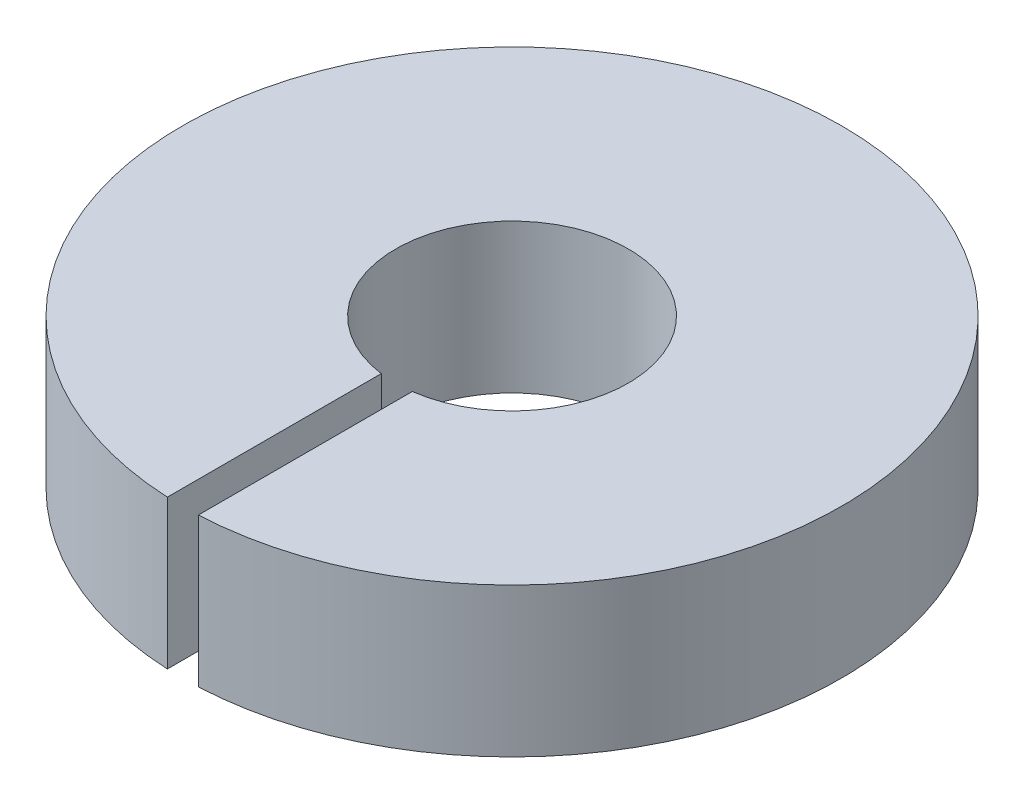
from build123d import *

# Parameters (mm, degrees)
BASE_EXTRUDE_DEPTH = 6.096
SKETCH2_R          = 1.1303
CUT_EXTRUDE1_DEPTH = 9.525
SKETCH3_R          = 2.38125
CUT_EXTRUDE2_DEPTH = 6.858


with BuildPart() as part:
    # Sketch1 → Base-Extrude (new body)
    with BuildSketch(Plane(origin=(0, 0, 0), x_dir=(1, 0, 0), z_dir=(0, 1, 0))):
        with BuildLine():
            Line((-0.635, -4.719976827), (-0.635, -13.478800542))
            ThreePointArc((-0.635, -13.478800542), (0, 13.49375), (0.635, -13.478800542))
            Line((0.635, -13.478800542), (0.635, -4.719976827))
            ThreePointArc((0.635, -4.719976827), (0, 4.7625), (-0.635, -4.719976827))
        make_face()
    extrude(amount=BASE_EXTRUDE_DEPTH)

    # Sketch2 → Cut-Extrude1 (cut, symmetric)
    with BuildSketch(Plane(origin=(0, 0, 0), x_dir=(0, 0, -1), z_dir=(1, 0, 0))):
        with Locations((-6.35, 3.048)):
            Circle(SKETCH2_R)
    extrude(amount=CUT_EXTRUDE1_DEPTH, both=True, mode=Mode.SUBTRACT)

    # Sketch3 → Cut-Extrude2 (cut)
    with BuildSketch(Plane.ZY.offset(-3.175)):
        with Locations((6.35, 3.048)):
            Circle(SKETCH3_R)
    extrude(amount=-CUT_EXTRUDE2_DEPTH, mode=Mode.SUBTRACT)


solid = part.part
